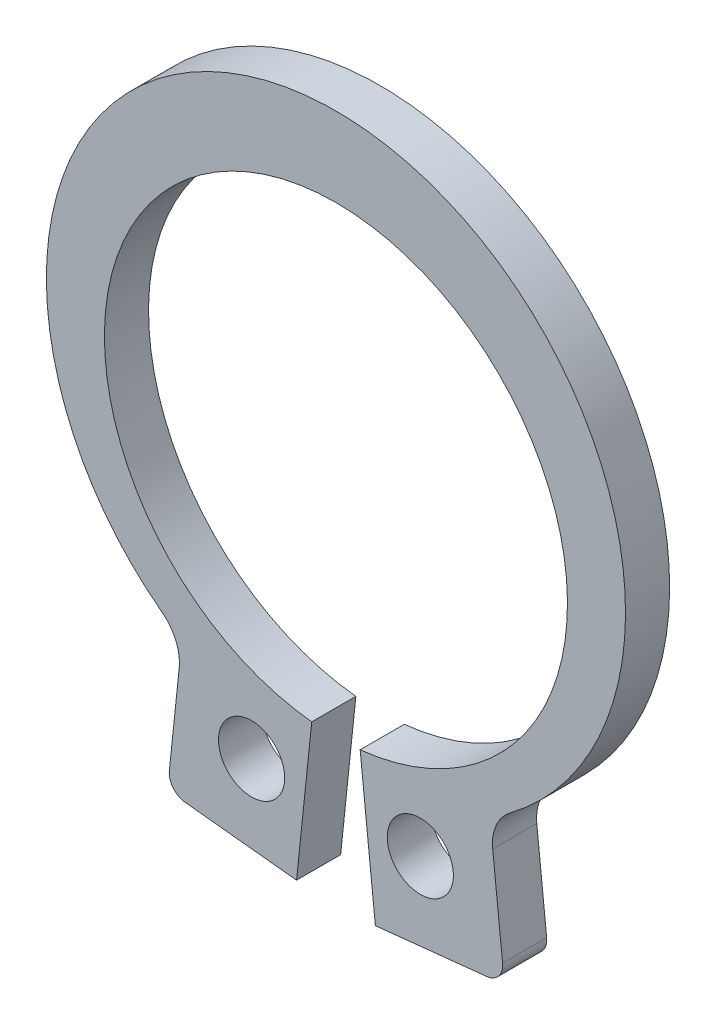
ISO-10303-21;
HEADER;
FILE_DESCRIPTION(('STEP AP214'),'2;1');
FILE_NAME('part.step','',(''),(''),'','','');
FILE_SCHEMA(('AUTOMOTIVE_DESIGN { 1 0 10303 214 1 1 1 1 }'));
ENDSEC;
DATA;
#1=APPLICATION_CONTEXT('core data for automotive mechanical design processes');
#2=APPLICATION_PROTOCOL_DEFINITION('international standard','automotive_design',2000,#1);
#3=PRODUCT_CONTEXT('',#1,'mechanical');
#4=PRODUCT('Part','Part','',(#3));
#5=PRODUCT_RELATED_PRODUCT_CATEGORY('part','',(#4));
#6=PRODUCT_DEFINITION_FORMATION('','',#4);
#7=PRODUCT_DEFINITION_CONTEXT('part definition',#1,'design');
#8=PRODUCT_DEFINITION('design','',#6,#7);
#9=PRODUCT_DEFINITION_SHAPE('','',#8);
#10=(LENGTH_UNIT() NAMED_UNIT(*) SI_UNIT(.MILLI.,.METRE.));
#11=(NAMED_UNIT(*) PLANE_ANGLE_UNIT() SI_UNIT($,.RADIAN.));
#12=(NAMED_UNIT(*) SI_UNIT($,.STERADIAN.) SOLID_ANGLE_UNIT());
#13=UNCERTAINTY_MEASURE_WITH_UNIT(LENGTH_MEASURE(1.E-05),#10,'distance_accuracy_value','');
#14=(GEOMETRIC_REPRESENTATION_CONTEXT(3) GLOBAL_UNCERTAINTY_ASSIGNED_CONTEXT((#13)) GLOBAL_UNIT_ASSIGNED_CONTEXT((#10,
#11,#12)) REPRESENTATION_CONTEXT('',''));
#15=CARTESIAN_POINT('',(0.,0.,0.));
#16=DIRECTION('',(0.,0.,1.));
#17=DIRECTION('',(1.,0.,0.));
#18=AXIS2_PLACEMENT_3D('',#15,#16,#17);
#19=CARTESIAN_POINT('',(0.,0.,1.));
#20=DIRECTION('',(0.,0.,1.));
#21=DIRECTION('',(1.,0.,0.));
#22=AXIS2_PLACEMENT_3D('',#19,#20,#21);
#23=PLANE('',#22);
#24=CARTESIAN_POINT('',(1.9129931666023,-6.62951409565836,1.));
#25=DIRECTION('',(0.,0.,1.));
#26=DIRECTION('',(-1.,0.,0.));
#27=AXIS2_PLACEMENT_3D('',#24,#25,#26);
#28=CIRCLE('',#27,0.75);
#29=CARTESIAN_POINT('',(1.1629931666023,-6.62951409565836,1.));
#30=VERTEX_POINT('',#29);
#31=EDGE_CURVE('E137',#30,#30,#28,.T.);
#32=ORIENTED_EDGE('',*,*,#31,.F.);
#33=EDGE_LOOP('',(#32));
#34=FACE_BOUND('',#33,.T.);
#35=CARTESIAN_POINT('',(0.,0.,1.));
#36=DIRECTION('',(0.,0.,-1.));
#37=DIRECTION('',(1.,0.,0.));
#38=AXIS2_PLACEMENT_3D('',#35,#36,#37);
#39=CIRCLE('',#38,5.25);
#40=CARTESIAN_POINT('',(-0.548774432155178,-5.22123995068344,1.));
#41=VERTEX_POINT('',#40);
#42=CARTESIAN_POINT('',(0.548774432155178,-5.22123995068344,1.));
#43=VERTEX_POINT('',#42);
#44=EDGE_CURVE('E163',#41,#43,#39,.T.);
#45=ORIENTED_EDGE('',*,*,#44,.T.);
#46=DIRECTION('',(0.104528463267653,-0.994521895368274,0.));
#47=VECTOR('',#46,1.);
#48=CARTESIAN_POINT('',(0.893718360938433,-8.50316220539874,1.));
#49=LINE('',#48,#47);
#50=CARTESIAN_POINT('',(0.893718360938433,-8.50316220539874,1.));
#51=VERTEX_POINT('',#50);
#52=EDGE_CURVE('E132',#43,#51,#49,.T.);
#53=ORIENTED_EDGE('',*,*,#52,.T.);
#54=DIRECTION('',(0.994521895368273,0.104528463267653,0.));
#55=VECTOR('',#54,1.);
#56=CARTESIAN_POINT('',(3.42221315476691,-8.23740669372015,1.));
#57=LINE('',#56,#55);
#58=CARTESIAN_POINT('',(3.42221315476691,-8.23740669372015,1.));
#59=VERTEX_POINT('',#58);
#60=EDGE_CURVE('E166',#51,#59,#57,.T.);
#61=ORIENTED_EDGE('',*,*,#60,.T.);
#62=CARTESIAN_POINT('',(3.38040176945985,-7.83959793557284,1.));
#63=DIRECTION('',(0.,0.,1.));
#64=DIRECTION('',(-1.,0.,0.));
#65=AXIS2_PLACEMENT_3D('',#62,#63,#64);
#66=CIRCLE('',#65,0.4);
#67=CARTESIAN_POINT('',(3.77821052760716,-7.79778655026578,1.));
#68=VERTEX_POINT('',#67);
#69=EDGE_CURVE('E168',#59,#68,#66,.T.);
#70=ORIENTED_EDGE('',*,*,#69,.T.);
#71=DIRECTION('',(-0.104528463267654,0.994521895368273,0.));
#72=VECTOR('',#71,1.);
#73=CARTESIAN_POINT('',(3.55418997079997,-5.66637332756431,1.));
#74=LINE('',#73,#72);
#75=CARTESIAN_POINT('',(3.55418997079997,-5.66637332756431,1.));
#76=VERTEX_POINT('',#75);
#77=EDGE_CURVE('E170',#68,#76,#74,.T.);
#78=ORIENTED_EDGE('',*,*,#77,.T.);
#79=CARTESIAN_POINT('',(4.54871186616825,-5.56184486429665,1.));
#80=DIRECTION('',(0.,0.,-1.));
#81=DIRECTION('',(1.,0.,0.));
#82=AXIS2_PLACEMENT_3D('',#79,#80,#81);
#83=CIRCLE('',#82,1.);
#84=CARTESIAN_POINT('',(3.94750364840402,-4.76275245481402,1.));
#85=VERTEX_POINT('',#84);
#86=EDGE_CURVE('E172',#76,#85,#83,.T.);
#87=ORIENTED_EDGE('',*,*,#86,.T.);
#88=CARTESIAN_POINT('',(0.,0.484049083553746,1.));
#89=DIRECTION('',(0.,0.,1.));
#90=DIRECTION('',(-1.,0.,0.));
#91=AXIS2_PLACEMENT_3D('',#88,#89,#90);
#92=CIRCLE('',#91,6.56595091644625);
#93=CARTESIAN_POINT('',(-3.94750364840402,-4.76275245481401,1.));
#94=VERTEX_POINT('',#93);
#95=EDGE_CURVE('E174',#85,#94,#92,.T.);
#96=ORIENTED_EDGE('',*,*,#95,.T.);
#97=CARTESIAN_POINT('',(-4.54871186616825,-5.56184486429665,1.));
#98=DIRECTION('',(0.,0.,-1.));
#99=DIRECTION('',(1.,0.,0.));
#100=AXIS2_PLACEMENT_3D('',#97,#98,#99);
#101=CIRCLE('',#100,1.);
#102=CARTESIAN_POINT('',(-3.55418997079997,-5.66637332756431,1.));
#103=VERTEX_POINT('',#102);
#104=EDGE_CURVE('E176',#94,#103,#101,.T.);
#105=ORIENTED_EDGE('',*,*,#104,.T.);
#106=DIRECTION('',(-0.104528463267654,-0.994521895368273,0.));
#107=VECTOR('',#106,1.);
#108=CARTESIAN_POINT('',(-3.77821052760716,-7.79778655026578,1.));
#109=LINE('',#108,#107);
#110=CARTESIAN_POINT('',(-3.77821052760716,-7.79778655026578,1.));
#111=VERTEX_POINT('',#110);
#112=EDGE_CURVE('E178',#103,#111,#109,.T.);
#113=ORIENTED_EDGE('',*,*,#112,.T.);
#114=CARTESIAN_POINT('',(-3.38040176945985,-7.83959793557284,1.));
#115=DIRECTION('',(0.,0.,1.));
#116=DIRECTION('',(-1.,0.,0.));
#117=AXIS2_PLACEMENT_3D('',#114,#115,#116);
#118=CIRCLE('',#117,0.4);
#119=CARTESIAN_POINT('',(-3.42221315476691,-8.23740669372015,1.));
#120=VERTEX_POINT('',#119);
#121=EDGE_CURVE('E180',#111,#120,#118,.T.);
#122=ORIENTED_EDGE('',*,*,#121,.T.);
#123=DIRECTION('',(0.994521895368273,-0.104528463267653,0.));
#124=VECTOR('',#123,1.);
#125=CARTESIAN_POINT('',(-0.893718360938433,-8.50316220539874,1.));
#126=LINE('',#125,#124);
#127=CARTESIAN_POINT('',(-0.893718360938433,-8.50316220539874,1.));
#128=VERTEX_POINT('',#127);
#129=EDGE_CURVE('E49',#120,#128,#126,.T.);
#130=ORIENTED_EDGE('',*,*,#129,.T.);
#131=DIRECTION('',(0.104528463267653,0.994521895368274,0.));
#132=VECTOR('',#131,1.);
#133=CARTESIAN_POINT('',(-0.548774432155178,-5.22123995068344,1.));
#134=LINE('',#133,#132);
#135=EDGE_CURVE('E44',#128,#41,#134,.T.);
#136=ORIENTED_EDGE('',*,*,#135,.T.);
#137=EDGE_LOOP('',(#45,#53,#61,#70,#78,#87,#96,#105,#113,#122,#130,#136));
#138=FACE_BOUND('',#137,.T.);
#139=CARTESIAN_POINT('',(-1.9129931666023,-6.62951409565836,1.));
#140=DIRECTION('',(0.,0.,1.));
#141=DIRECTION('',(-1.,0.,0.));
#142=AXIS2_PLACEMENT_3D('',#139,#140,#141);
#143=CIRCLE('',#142,0.75);
#144=CARTESIAN_POINT('',(-2.6629931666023,-6.62951409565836,1.));
#145=VERTEX_POINT('',#144);
#146=EDGE_CURVE('E286',#145,#145,#143,.T.);
#147=ORIENTED_EDGE('',*,*,#146,.F.);
#148=EDGE_LOOP('',(#147));
#149=FACE_BOUND('',#148,.T.);
#150=ADVANCED_FACE('F29',(#34,#138,#149),#23,.T.);
#151=CARTESIAN_POINT('',(0.,0.,0.));
#152=DIRECTION('',(0.,0.,1.));
#153=DIRECTION('',(1.,0.,0.));
#154=AXIS2_PLACEMENT_3D('',#151,#152,#153);
#155=PLANE('',#154);
#156=CARTESIAN_POINT('',(1.9129931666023,-6.62951409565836,0.));
#157=DIRECTION('',(0.,0.,1.));
#158=DIRECTION('',(-1.,0.,0.));
#159=AXIS2_PLACEMENT_3D('',#156,#157,#158);
#160=CIRCLE('',#159,0.75);
#161=CARTESIAN_POINT('',(1.1629931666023,-6.62951409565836,0.));
#162=VERTEX_POINT('',#161);
#163=EDGE_CURVE('E140',#162,#162,#160,.T.);
#164=ORIENTED_EDGE('',*,*,#163,.T.);
#165=EDGE_LOOP('',(#164));
#166=FACE_BOUND('',#165,.T.);
#167=CARTESIAN_POINT('',(0.,0.,0.));
#168=DIRECTION('',(0.,0.,-1.));
#169=DIRECTION('',(1.,0.,0.));
#170=AXIS2_PLACEMENT_3D('',#167,#168,#169);
#171=CIRCLE('',#170,5.25);
#172=CARTESIAN_POINT('',(-0.548774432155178,-5.22123995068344,0.));
#173=VERTEX_POINT('',#172);
#174=CARTESIAN_POINT('',(0.548774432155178,-5.22123995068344,0.));
#175=VERTEX_POINT('',#174);
#176=EDGE_CURVE('E123',#173,#175,#171,.T.);
#177=ORIENTED_EDGE('',*,*,#176,.F.);
#178=DIRECTION('',(0.104528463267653,0.994521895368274,0.));
#179=VECTOR('',#178,1.);
#180=CARTESIAN_POINT('',(-0.548774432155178,-5.22123995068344,0.));
#181=LINE('',#180,#179);
#182=CARTESIAN_POINT('',(-0.893718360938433,-8.50316220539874,0.));
#183=VERTEX_POINT('',#182);
#184=EDGE_CURVE('E161',#183,#173,#181,.T.);
#185=ORIENTED_EDGE('',*,*,#184,.F.);
#186=DIRECTION('',(0.994521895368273,-0.104528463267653,0.));
#187=VECTOR('',#186,1.);
#188=CARTESIAN_POINT('',(-0.893718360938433,-8.50316220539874,0.));
#189=LINE('',#188,#187);
#190=CARTESIAN_POINT('',(-3.42221315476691,-8.23740669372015,0.));
#191=VERTEX_POINT('',#190);
#192=EDGE_CURVE('E159',#191,#183,#189,.T.);
#193=ORIENTED_EDGE('',*,*,#192,.F.);
#194=CARTESIAN_POINT('',(-3.38040176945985,-7.83959793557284,0.));
#195=DIRECTION('',(0.,0.,1.));
#196=DIRECTION('',(-1.,0.,0.));
#197=AXIS2_PLACEMENT_3D('',#194,#195,#196);
#198=CIRCLE('',#197,0.4);
#199=CARTESIAN_POINT('',(-3.77821052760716,-7.79778655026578,0.));
#200=VERTEX_POINT('',#199);
#201=EDGE_CURVE('E157',#200,#191,#198,.T.);
#202=ORIENTED_EDGE('',*,*,#201,.F.);
#203=DIRECTION('',(-0.104528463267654,-0.994521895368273,0.));
#204=VECTOR('',#203,1.);
#205=CARTESIAN_POINT('',(-3.77821052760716,-7.79778655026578,0.));
#206=LINE('',#205,#204);
#207=CARTESIAN_POINT('',(-3.55418997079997,-5.66637332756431,0.));
#208=VERTEX_POINT('',#207);
#209=EDGE_CURVE('E155',#208,#200,#206,.T.);
#210=ORIENTED_EDGE('',*,*,#209,.F.);
#211=CARTESIAN_POINT('',(-4.54871186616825,-5.56184486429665,0.));
#212=DIRECTION('',(0.,0.,-1.));
#213=DIRECTION('',(1.,0.,0.));
#214=AXIS2_PLACEMENT_3D('',#211,#212,#213);
#215=CIRCLE('',#214,1.);
#216=CARTESIAN_POINT('',(-3.94750364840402,-4.76275245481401,0.));
#217=VERTEX_POINT('',#216);
#218=EDGE_CURVE('E153',#217,#208,#215,.T.);
#219=ORIENTED_EDGE('',*,*,#218,.F.);
#220=CARTESIAN_POINT('',(0.,0.484049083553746,0.));
#221=DIRECTION('',(0.,0.,1.));
#222=DIRECTION('',(-1.,0.,0.));
#223=AXIS2_PLACEMENT_3D('',#220,#221,#222);
#224=CIRCLE('',#223,6.56595091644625);
#225=CARTESIAN_POINT('',(3.94750364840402,-4.76275245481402,0.));
#226=VERTEX_POINT('',#225);
#227=EDGE_CURVE('E151',#226,#217,#224,.T.);
#228=ORIENTED_EDGE('',*,*,#227,.F.);
#229=CARTESIAN_POINT('',(4.54871186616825,-5.56184486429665,0.));
#230=DIRECTION('',(0.,0.,-1.));
#231=DIRECTION('',(1.,0.,0.));
#232=AXIS2_PLACEMENT_3D('',#229,#230,#231);
#233=CIRCLE('',#232,1.);
#234=CARTESIAN_POINT('',(3.55418997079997,-5.66637332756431,0.));
#235=VERTEX_POINT('',#234);
#236=EDGE_CURVE('E149',#235,#226,#233,.T.);
#237=ORIENTED_EDGE('',*,*,#236,.F.);
#238=DIRECTION('',(-0.104528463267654,0.994521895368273,0.));
#239=VECTOR('',#238,1.);
#240=CARTESIAN_POINT('',(3.55418997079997,-5.66637332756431,0.));
#241=LINE('',#240,#239);
#242=CARTESIAN_POINT('',(3.77821052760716,-7.79778655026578,0.));
#243=VERTEX_POINT('',#242);
#244=EDGE_CURVE('E147',#243,#235,#241,.T.);
#245=ORIENTED_EDGE('',*,*,#244,.F.);
#246=CARTESIAN_POINT('',(3.38040176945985,-7.83959793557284,0.));
#247=DIRECTION('',(0.,0.,1.));
#248=DIRECTION('',(-1.,0.,0.));
#249=AXIS2_PLACEMENT_3D('',#246,#247,#248);
#250=CIRCLE('',#249,0.4);
#251=CARTESIAN_POINT('',(3.42221315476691,-8.23740669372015,0.));
#252=VERTEX_POINT('',#251);
#253=EDGE_CURVE('E145',#252,#243,#250,.T.);
#254=ORIENTED_EDGE('',*,*,#253,.F.);
#255=DIRECTION('',(0.994521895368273,0.104528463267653,0.));
#256=VECTOR('',#255,1.);
#257=CARTESIAN_POINT('',(3.42221315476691,-8.23740669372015,0.));
#258=LINE('',#257,#256);
#259=CARTESIAN_POINT('',(0.893718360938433,-8.50316220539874,0.));
#260=VERTEX_POINT('',#259);
#261=EDGE_CURVE('E125',#260,#252,#258,.T.);
#262=ORIENTED_EDGE('',*,*,#261,.F.);
#263=DIRECTION('',(0.104528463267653,-0.994521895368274,0.));
#264=VECTOR('',#263,1.);
#265=CARTESIAN_POINT('',(0.893718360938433,-8.50316220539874,0.));
#266=LINE('',#265,#264);
#267=EDGE_CURVE('E118',#175,#260,#266,.T.);
#268=ORIENTED_EDGE('',*,*,#267,.F.);
#269=EDGE_LOOP('',(#177,#185,#193,#202,#210,#219,#228,#237,#245,#254,#262,#268));
#270=FACE_BOUND('',#269,.T.);
#271=CARTESIAN_POINT('',(-1.9129931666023,-6.62951409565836,0.));
#272=DIRECTION('',(0.,0.,1.));
#273=DIRECTION('',(-1.,0.,0.));
#274=AXIS2_PLACEMENT_3D('',#271,#272,#273);
#275=CIRCLE('',#274,0.75);
#276=CARTESIAN_POINT('',(-2.6629931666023,-6.62951409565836,0.));
#277=VERTEX_POINT('',#276);
#278=EDGE_CURVE('E283',#277,#277,#275,.T.);
#279=ORIENTED_EDGE('',*,*,#278,.T.);
#280=EDGE_LOOP('',(#279));
#281=FACE_BOUND('',#280,.T.);
#282=ADVANCED_FACE('F119',(#166,#270,#281),#155,.F.);
#283=CARTESIAN_POINT('',(0.,0.,1.));
#284=DIRECTION('',(0.,0.,-1.));
#285=DIRECTION('',(-1.,0.,0.));
#286=AXIS2_PLACEMENT_3D('',#283,#284,#285);
#287=CYLINDRICAL_SURFACE('',#286,5.25);
#288=ORIENTED_EDGE('',*,*,#176,.T.);
#289=DIRECTION('',(0.,0.,-1.));
#290=VECTOR('',#289,1.);
#291=CARTESIAN_POINT('',(0.548774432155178,-5.22123995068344,1.));
#292=LINE('',#291,#290);
#293=EDGE_CURVE('E11',#43,#175,#292,.T.);
#294=ORIENTED_EDGE('',*,*,#293,.F.);
#295=ORIENTED_EDGE('',*,*,#44,.F.);
#296=DIRECTION('',(0.,0.,-1.));
#297=VECTOR('',#296,1.);
#298=CARTESIAN_POINT('',(-0.548774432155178,-5.22123995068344,1.));
#299=LINE('',#298,#297);
#300=EDGE_CURVE('E136',#41,#173,#299,.T.);
#301=ORIENTED_EDGE('',*,*,#300,.T.);
#302=EDGE_LOOP('',(#288,#294,#295,#301));
#303=FACE_BOUND('',#302,.T.);
#304=ADVANCED_FACE('F31',(#303),#287,.F.);
#305=CARTESIAN_POINT('',(0.893718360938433,-8.50316220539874,1.));
#306=DIRECTION('',(0.994521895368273,0.104528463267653,0.));
#307=DIRECTION('',(-0.104528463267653,0.994521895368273,0.));
#308=AXIS2_PLACEMENT_3D('',#305,#306,#307);
#309=PLANE('',#308);
#310=ORIENTED_EDGE('',*,*,#267,.T.);
#311=DIRECTION('',(0.,0.,-1.));
#312=VECTOR('',#311,1.);
#313=CARTESIAN_POINT('',(0.893718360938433,-8.50316220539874,1.));
#314=LINE('',#313,#312);
#315=EDGE_CURVE('E37',#51,#260,#314,.T.);
#316=ORIENTED_EDGE('',*,*,#315,.F.);
#317=ORIENTED_EDGE('',*,*,#52,.F.);
#318=ORIENTED_EDGE('',*,*,#293,.T.);
#319=EDGE_LOOP('',(#310,#316,#317,#318));
#320=FACE_BOUND('',#319,.T.);
#321=ADVANCED_FACE('F131',(#320),#309,.F.);
#322=CARTESIAN_POINT('',(3.42221315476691,-8.23740669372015,1.));
#323=DIRECTION('',(-0.104528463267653,0.994521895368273,0.));
#324=DIRECTION('',(-0.994521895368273,-0.104528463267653,0.));
#325=AXIS2_PLACEMENT_3D('',#322,#323,#324);
#326=PLANE('',#325);
#327=ORIENTED_EDGE('',*,*,#261,.T.);
#328=DIRECTION('',(0.,0.,-1.));
#329=VECTOR('',#328,1.);
#330=CARTESIAN_POINT('',(3.42221315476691,-8.23740669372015,1.));
#331=LINE('',#330,#329);
#332=EDGE_CURVE('E209',#59,#252,#331,.T.);
#333=ORIENTED_EDGE('',*,*,#332,.F.);
#334=ORIENTED_EDGE('',*,*,#60,.F.);
#335=ORIENTED_EDGE('',*,*,#315,.T.);
#336=EDGE_LOOP('',(#327,#333,#334,#335));
#337=FACE_BOUND('',#336,.T.);
#338=ADVANCED_FACE('F213',(#337),#326,.F.);
#339=CARTESIAN_POINT('',(3.38040176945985,-7.83959793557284,1.));
#340=DIRECTION('',(0.,0.,-1.));
#341=DIRECTION('',(-1.,0.,0.));
#342=AXIS2_PLACEMENT_3D('',#339,#340,#341);
#343=CYLINDRICAL_SURFACE('',#342,0.4);
#344=ORIENTED_EDGE('',*,*,#253,.T.);
#345=DIRECTION('',(0.,0.,-1.));
#346=VECTOR('',#345,1.);
#347=CARTESIAN_POINT('',(3.77821052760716,-7.79778655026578,1.));
#348=LINE('',#347,#346);
#349=EDGE_CURVE('E206',#68,#243,#348,.T.);
#350=ORIENTED_EDGE('',*,*,#349,.F.);
#351=ORIENTED_EDGE('',*,*,#69,.F.);
#352=ORIENTED_EDGE('',*,*,#332,.T.);
#353=EDGE_LOOP('',(#344,#350,#351,#352));
#354=FACE_BOUND('',#353,.T.);
#355=ADVANCED_FACE('F221',(#354),#343,.T.);
#356=CARTESIAN_POINT('',(3.55418997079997,-5.66637332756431,1.));
#357=DIRECTION('',(-0.994521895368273,-0.104528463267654,0.));
#358=DIRECTION('',(0.104528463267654,-0.994521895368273,0.));
#359=AXIS2_PLACEMENT_3D('',#356,#357,#358);
#360=PLANE('',#359);
#361=ORIENTED_EDGE('',*,*,#244,.T.);
#362=DIRECTION('',(0.,0.,-1.));
#363=VECTOR('',#362,1.);
#364=CARTESIAN_POINT('',(3.55418997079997,-5.66637332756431,1.));
#365=LINE('',#364,#363);
#366=EDGE_CURVE('E203',#76,#235,#365,.T.);
#367=ORIENTED_EDGE('',*,*,#366,.F.);
#368=ORIENTED_EDGE('',*,*,#77,.F.);
#369=ORIENTED_EDGE('',*,*,#349,.T.);
#370=EDGE_LOOP('',(#361,#367,#368,#369));
#371=FACE_BOUND('',#370,.T.);
#372=ADVANCED_FACE('F224',(#371),#360,.F.);
#373=CARTESIAN_POINT('',(4.54871186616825,-5.56184486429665,1.));
#374=DIRECTION('',(0.,0.,-1.));
#375=DIRECTION('',(-1.,0.,0.));
#376=AXIS2_PLACEMENT_3D('',#373,#374,#375);
#377=CYLINDRICAL_SURFACE('',#376,1.);
#378=ORIENTED_EDGE('',*,*,#236,.T.);
#379=DIRECTION('',(0.,0.,-1.));
#380=VECTOR('',#379,1.);
#381=CARTESIAN_POINT('',(3.94750364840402,-4.76275245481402,1.));
#382=LINE('',#381,#380);
#383=EDGE_CURVE('E200',#85,#226,#382,.T.);
#384=ORIENTED_EDGE('',*,*,#383,.F.);
#385=ORIENTED_EDGE('',*,*,#86,.F.);
#386=ORIENTED_EDGE('',*,*,#366,.T.);
#387=EDGE_LOOP('',(#378,#384,#385,#386));
#388=FACE_BOUND('',#387,.T.);
#389=ADVANCED_FACE('F229',(#388),#377,.F.);
#390=CARTESIAN_POINT('',(0.,0.484049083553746,1.));
#391=DIRECTION('',(0.,0.,-1.));
#392=DIRECTION('',(-1.,0.,0.));
#393=AXIS2_PLACEMENT_3D('',#390,#391,#392);
#394=CYLINDRICAL_SURFACE('',#393,6.56595091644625);
#395=ORIENTED_EDGE('',*,*,#227,.T.);
#396=DIRECTION('',(0.,0.,-1.));
#397=VECTOR('',#396,1.);
#398=CARTESIAN_POINT('',(-3.94750364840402,-4.76275245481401,1.));
#399=LINE('',#398,#397);
#400=EDGE_CURVE('E197',#94,#217,#399,.T.);
#401=ORIENTED_EDGE('',*,*,#400,.F.);
#402=ORIENTED_EDGE('',*,*,#95,.F.);
#403=ORIENTED_EDGE('',*,*,#383,.T.);
#404=EDGE_LOOP('',(#395,#401,#402,#403));
#405=FACE_BOUND('',#404,.T.);
#406=ADVANCED_FACE('F235',(#405),#394,.T.);
#407=CARTESIAN_POINT('',(-4.54871186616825,-5.56184486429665,1.));
#408=DIRECTION('',(0.,0.,-1.));
#409=DIRECTION('',(-1.,0.,0.));
#410=AXIS2_PLACEMENT_3D('',#407,#408,#409);
#411=CYLINDRICAL_SURFACE('',#410,1.);
#412=ORIENTED_EDGE('',*,*,#218,.T.);
#413=DIRECTION('',(0.,0.,-1.));
#414=VECTOR('',#413,1.);
#415=CARTESIAN_POINT('',(-3.55418997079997,-5.66637332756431,1.));
#416=LINE('',#415,#414);
#417=EDGE_CURVE('E194',#103,#208,#416,.T.);
#418=ORIENTED_EDGE('',*,*,#417,.F.);
#419=ORIENTED_EDGE('',*,*,#104,.F.);
#420=ORIENTED_EDGE('',*,*,#400,.T.);
#421=EDGE_LOOP('',(#412,#418,#419,#420));
#422=FACE_BOUND('',#421,.T.);
#423=ADVANCED_FACE('F239',(#422),#411,.F.);
#424=CARTESIAN_POINT('',(-3.77821052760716,-7.79778655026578,1.));
#425=DIRECTION('',(0.994521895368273,-0.104528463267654,0.));
#426=DIRECTION('',(0.104528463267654,0.994521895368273,0.));
#427=AXIS2_PLACEMENT_3D('',#424,#425,#426);
#428=PLANE('',#427);
#429=ORIENTED_EDGE('',*,*,#209,.T.);
#430=DIRECTION('',(0.,0.,-1.));
#431=VECTOR('',#430,1.);
#432=CARTESIAN_POINT('',(-3.77821052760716,-7.79778655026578,1.));
#433=LINE('',#432,#431);
#434=EDGE_CURVE('E191',#111,#200,#433,.T.);
#435=ORIENTED_EDGE('',*,*,#434,.F.);
#436=ORIENTED_EDGE('',*,*,#112,.F.);
#437=ORIENTED_EDGE('',*,*,#417,.T.);
#438=EDGE_LOOP('',(#429,#435,#436,#437));
#439=FACE_BOUND('',#438,.T.);
#440=ADVANCED_FACE('F244',(#439),#428,.F.);
#441=CARTESIAN_POINT('',(-3.38040176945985,-7.83959793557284,1.));
#442=DIRECTION('',(0.,0.,-1.));
#443=DIRECTION('',(-1.,0.,0.));
#444=AXIS2_PLACEMENT_3D('',#441,#442,#443);
#445=CYLINDRICAL_SURFACE('',#444,0.4);
#446=ORIENTED_EDGE('',*,*,#201,.T.);
#447=DIRECTION('',(0.,0.,-1.));
#448=VECTOR('',#447,1.);
#449=CARTESIAN_POINT('',(-3.42221315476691,-8.23740669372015,1.));
#450=LINE('',#449,#448);
#451=EDGE_CURVE('E188',#120,#191,#450,.T.);
#452=ORIENTED_EDGE('',*,*,#451,.F.);
#453=ORIENTED_EDGE('',*,*,#121,.F.);
#454=ORIENTED_EDGE('',*,*,#434,.T.);
#455=EDGE_LOOP('',(#446,#452,#453,#454));
#456=FACE_BOUND('',#455,.T.);
#457=ADVANCED_FACE('F248',(#456),#445,.T.);
#458=CARTESIAN_POINT('',(-0.893718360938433,-8.50316220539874,1.));
#459=DIRECTION('',(0.104528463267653,0.994521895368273,0.));
#460=DIRECTION('',(-0.994521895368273,0.104528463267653,0.));
#461=AXIS2_PLACEMENT_3D('',#458,#459,#460);
#462=PLANE('',#461);
#463=ORIENTED_EDGE('',*,*,#192,.T.);
#464=DIRECTION('',(0.,0.,-1.));
#465=VECTOR('',#464,1.);
#466=CARTESIAN_POINT('',(-0.893718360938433,-8.50316220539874,1.));
#467=LINE('',#466,#465);
#468=EDGE_CURVE('E185',#128,#183,#467,.T.);
#469=ORIENTED_EDGE('',*,*,#468,.F.);
#470=ORIENTED_EDGE('',*,*,#129,.F.);
#471=ORIENTED_EDGE('',*,*,#451,.T.);
#472=EDGE_LOOP('',(#463,#469,#470,#471));
#473=FACE_BOUND('',#472,.T.);
#474=ADVANCED_FACE('F252',(#473),#462,.F.);
#475=CARTESIAN_POINT('',(-0.548774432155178,-5.22123995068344,1.));
#476=DIRECTION('',(-0.994521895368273,0.104528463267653,0.));
#477=DIRECTION('',(-0.104528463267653,-0.994521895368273,0.));
#478=AXIS2_PLACEMENT_3D('',#475,#476,#477);
#479=PLANE('',#478);
#480=ORIENTED_EDGE('',*,*,#184,.T.);
#481=ORIENTED_EDGE('',*,*,#300,.F.);
#482=ORIENTED_EDGE('',*,*,#135,.F.);
#483=ORIENTED_EDGE('',*,*,#468,.T.);
#484=EDGE_LOOP('',(#480,#481,#482,#483));
#485=FACE_BOUND('',#484,.T.);
#486=ADVANCED_FACE('F254',(#485),#479,.F.);
#487=CARTESIAN_POINT('',(1.9129931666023,-6.62951409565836,1.));
#488=DIRECTION('',(0.,0.,-1.));
#489=DIRECTION('',(-1.,0.,0.));
#490=AXIS2_PLACEMENT_3D('',#487,#488,#489);
#491=CYLINDRICAL_SURFACE('',#490,0.75);
#492=ORIENTED_EDGE('',*,*,#163,.F.);
#493=EDGE_LOOP('',(#492));
#494=FACE_BOUND('',#493,.T.);
#495=ORIENTED_EDGE('',*,*,#31,.T.);
#496=EDGE_LOOP('',(#495));
#497=FACE_BOUND('',#496,.T.);
#498=ADVANCED_FACE('F256',(#494,#497),#491,.F.);
#499=CARTESIAN_POINT('',(-1.9129931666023,-6.62951409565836,1.));
#500=DIRECTION('',(0.,0.,-1.));
#501=DIRECTION('',(-1.,0.,0.));
#502=AXIS2_PLACEMENT_3D('',#499,#500,#501);
#503=CYLINDRICAL_SURFACE('',#502,0.75);
#504=ORIENTED_EDGE('',*,*,#278,.F.);
#505=EDGE_LOOP('',(#504));
#506=FACE_BOUND('',#505,.T.);
#507=ORIENTED_EDGE('',*,*,#146,.T.);
#508=EDGE_LOOP('',(#507));
#509=FACE_BOUND('',#508,.T.);
#510=ADVANCED_FACE('F262',(#506,#509),#503,.F.);
#511=CLOSED_SHELL('',(#150,#282,#304,#321,#338,#355,#372,#389,#406,#423,#440,#457,#474,#486,
#498,#510));
#512=MANIFOLD_SOLID_BREP('B2',#511);
#513=ADVANCED_BREP_SHAPE_REPRESENTATION('',(#18,#512),#14);
#514=SHAPE_DEFINITION_REPRESENTATION(#9,#513);
ENDSEC;
END-ISO-10303-21;
